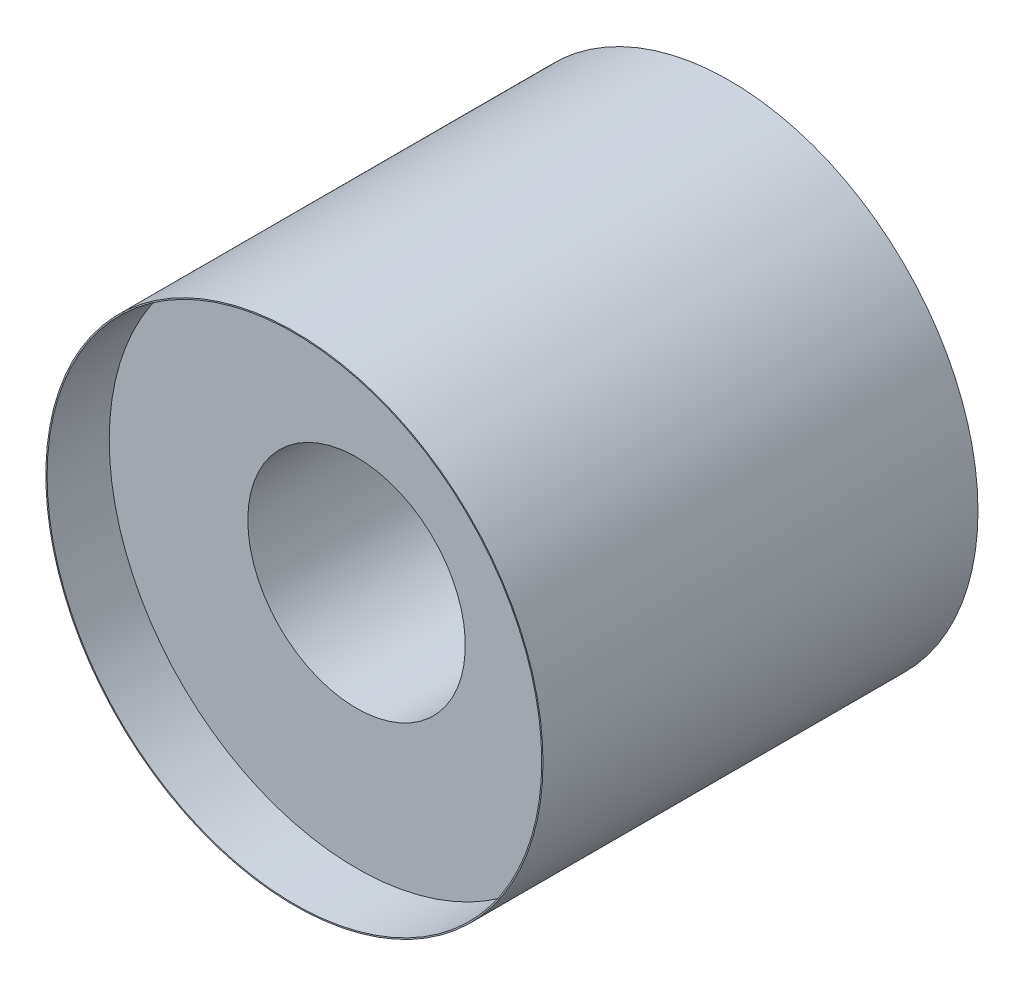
from build123d import *

# Parameters (mm, degrees)
SKETCH1_R           = 25.4
BOSS_EXTRUDE1_DEPTH = 44.45
SKETCH2_R           = 25.273
CUT_EXTRUDE1_DEPTH  = 6.35
CUT_EXTRUDE2_START  = -6.35
SKETCH3_R           = 25.273
CUT_EXTRUDE2_DEPTH  = 6.35
SKETCH4_R           = 11.1125
CUT_EXTRUDE3_DEPTH  = 31.75


with BuildPart() as part:
    # Sketch1 → Boss-Extrude1 (new body)
    with BuildSketch(Plane.XY):
        Circle(SKETCH1_R)
    extrude(amount=BOSS_EXTRUDE1_DEPTH)

    # Sketch2 → Cut-Extrude1 (cut)
    with BuildSketch(Plane.XY.offset(44.45)):
        Circle(SKETCH2_R)
    extrude(amount=-CUT_EXTRUDE1_DEPTH, mode=Mode.SUBTRACT)

    # Sketch3 → Cut-Extrude2 (cut)
    with BuildSketch(Plane(origin=(0, 0, 0), x_dir=(-1, 0, 0), z_dir=(0, 0, -1)).offset(CUT_EXTRUDE2_START)):
        with Locations(Location((0, 0, 0), (0, 0, 180))):
            Circle(SKETCH3_R)
    extrude(amount=CUT_EXTRUDE2_DEPTH, mode=Mode.SUBTRACT)

    # Sketch4 → Cut-Extrude3 (cut)
    with BuildSketch(Plane(origin=(0, 0, 6.35), x_dir=(-1, 0, 0), z_dir=(0, 0, -1))):
        Circle(SKETCH4_R)
    extrude(amount=-CUT_EXTRUDE3_DEPTH, mode=Mode.SUBTRACT)


solid = part.part
